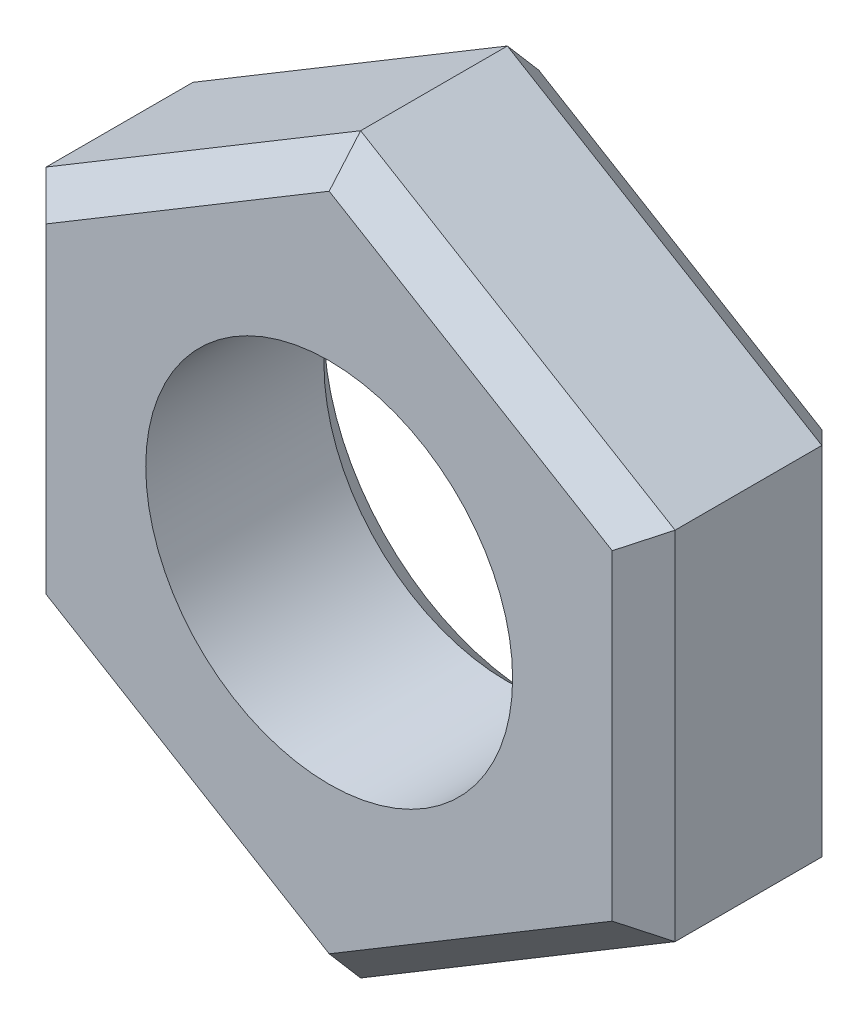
from build123d import *

# Parameters (mm, degrees)
ESQUISSE1_R      = 8.75
EXTRUSION1_DEPTH = 10
CHANFREIN1_SIZE  = 1.5


with BuildPart() as part:
    # Esquisse1 → Extrusion1 (new body)
    with BuildSketch(Plane.XY):
        Polygon((-15, -8.5), (-15, 8.5), (0, 17.5), (15, 8.5), (15, -8.5), (0, -17.5), align=None)
        Circle(ESQUISSE1_R, mode=Mode.SUBTRACT)
    extrude(amount=EXTRUSION1_DEPTH)

    # Chanfrein1
    chanfrein1_edges = [part.edges().sort_by_distance(p)[0] for p in [
        (-15, 0, 10),
        (-7.5, -13, 10),
        (-8.75, 0, 0),
        (7.5, -13, 10),
        (15, 0, 10),
        (7.5, 13, 10),
        (15, 0, 0),
        (7.5, -13, 0),
        (-7.5, -13, 0),
        (-15, 0, 0),
        (-7.5, 13, 10),
        (-7.5, 13, 0),
        (7.5, 13, 0),
    ]]
    chamfer(chanfrein1_edges, length=CHANFREIN1_SIZE)


solid = part.part
